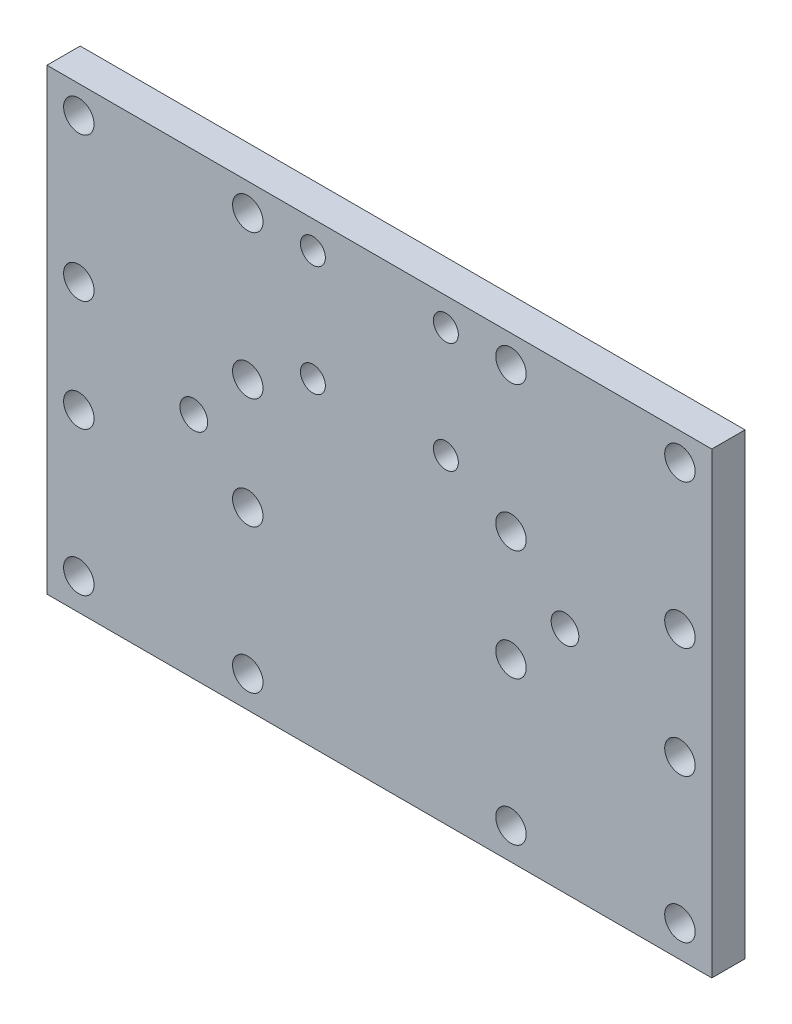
from build123d import *

# Parameters (mm, degrees)
CROQUIS1_W              = 120
CROQUIS1_H              = 82.685864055
CROQUIS1_R              = 2.75
CROQUIS1_R_2            = 2.25
SALIENTE_EXTRUIR1_DEPTH = 6
CROQUIS2_R              = 2.5
CORTAR_EXTRUIR1_DEPTH   = 6


with BuildPart() as part:
    # Croquis1 → Saliente-Extruir1 (new body)
    with BuildSketch(Plane.XY):
        with Locations((-598.252910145, 240.130205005)):
            Rectangle(CROQUIS1_W, CROQUIS1_H)
        with Locations((-652.502910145, 276.473137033)):
            Circle(CROQUIS1_R, mode=Mode.SUBTRACT)
        with Locations((-622.002910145, 276.473137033)):
            Circle(CROQUIS1_R, mode=Mode.SUBTRACT)
        with Locations((-610.252910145, 276.473137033)):
            Circle(CROQUIS1_R_2, mode=Mode.SUBTRACT)
        with Locations((-586.252910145, 276.473137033)):
            Circle(CROQUIS1_R_2, mode=Mode.SUBTRACT)
        with Locations((-574.502910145, 276.473137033)):
            Circle(CROQUIS1_R, mode=Mode.SUBTRACT)
        with Locations((-544.002910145, 276.473137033)):
            Circle(CROQUIS1_R, mode=Mode.SUBTRACT)
        with Locations((-544.002910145, 250.473137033)):
            Circle(CROQUIS1_R, mode=Mode.SUBTRACT)
        with Locations((-574.502910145, 250.473137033)):
            Circle(CROQUIS1_R, mode=Mode.SUBTRACT)
        with Locations((-586.252910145, 256.473137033)):
            Circle(CROQUIS1_R_2, mode=Mode.SUBTRACT)
        with Locations((-610.252910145, 256.473137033)):
            Circle(CROQUIS1_R_2, mode=Mode.SUBTRACT)
        with Locations((-622.002910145, 250.473137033)):
            Circle(CROQUIS1_R, mode=Mode.SUBTRACT)
        with Locations((-652.502910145, 250.473137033)):
            Circle(CROQUIS1_R, mode=Mode.SUBTRACT)
        with Locations((-652.502910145, 230.473137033)):
            Circle(CROQUIS1_R, mode=Mode.SUBTRACT)
        with Locations((-622.002910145, 230.473137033)):
            Circle(CROQUIS1_R, mode=Mode.SUBTRACT)
        with Locations((-652.502910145, 204.473137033)):
            Circle(CROQUIS1_R, mode=Mode.SUBTRACT)
        with Locations((-622.002910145, 204.473137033)):
            Circle(CROQUIS1_R, mode=Mode.SUBTRACT)
        with Locations((-574.502910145, 230.473137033)):
            Circle(CROQUIS1_R, mode=Mode.SUBTRACT)
        with Locations((-574.502910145, 204.473137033)):
            Circle(CROQUIS1_R, mode=Mode.SUBTRACT)
        with Locations((-544.002910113, 204.473137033)):
            Circle(CROQUIS1_R, mode=Mode.SUBTRACT)
        with Locations((-544.002910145, 230.473137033)):
            Circle(CROQUIS1_R, mode=Mode.SUBTRACT)
    extrude(amount=SALIENTE_EXTRUIR1_DEPTH)

    # Croquis2 → Cortar-Extruir1 (cut)
    with BuildSketch(Plane.XY.offset(6)):
        with Locations((-631.752910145, 240.130205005)):
            Circle(CROQUIS2_R)
        with Locations((-564.752910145, 240.130205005)):
            Circle(CROQUIS2_R)
    extrude(amount=-CORTAR_EXTRUIR1_DEPTH, mode=Mode.SUBTRACT)


solid = part.part
